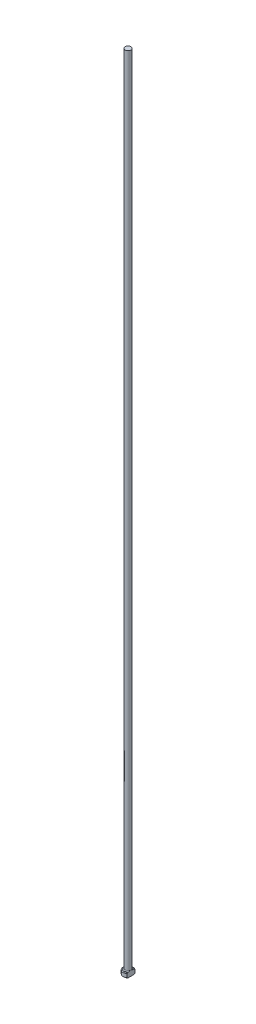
ISO-10303-21;
HEADER;
FILE_DESCRIPTION(('STEP AP214'),'2;1');
FILE_NAME('part.step','',(''),(''),'','','');
FILE_SCHEMA(('AUTOMOTIVE_DESIGN { 1 0 10303 214 1 1 1 1 }'));
ENDSEC;
DATA;
#1=APPLICATION_CONTEXT('core data for automotive mechanical design processes');
#2=APPLICATION_PROTOCOL_DEFINITION('international standard','automotive_design',2000,#1);
#3=PRODUCT_CONTEXT('',#1,'mechanical');
#4=PRODUCT('Part','Part','',(#3));
#5=PRODUCT_RELATED_PRODUCT_CATEGORY('part','',(#4));
#6=PRODUCT_DEFINITION_FORMATION('','',#4);
#7=PRODUCT_DEFINITION_CONTEXT('part definition',#1,'design');
#8=PRODUCT_DEFINITION('design','',#6,#7);
#9=PRODUCT_DEFINITION_SHAPE('','',#8);
#10=(LENGTH_UNIT() NAMED_UNIT(*) SI_UNIT(.MILLI.,.METRE.));
#11=(NAMED_UNIT(*) PLANE_ANGLE_UNIT() SI_UNIT($,.RADIAN.));
#12=(NAMED_UNIT(*) SI_UNIT($,.STERADIAN.) SOLID_ANGLE_UNIT());
#13=UNCERTAINTY_MEASURE_WITH_UNIT(LENGTH_MEASURE(1.E-05),#10,'distance_accuracy_value','');
#14=(GEOMETRIC_REPRESENTATION_CONTEXT(3) GLOBAL_UNCERTAINTY_ASSIGNED_CONTEXT((#13)) GLOBAL_UNIT_ASSIGNED_CONTEXT((#10,
#11,#12)) REPRESENTATION_CONTEXT('',''));
#15=CARTESIAN_POINT('',(0.,0.,0.));
#16=DIRECTION('',(0.,0.,1.));
#17=DIRECTION('',(1.,0.,0.));
#18=AXIS2_PLACEMENT_3D('',#15,#16,#17);
#19=CARTESIAN_POINT('',(0.,0.,0.));
#20=DIRECTION('',(0.,-1.,0.));
#21=DIRECTION('',(0.,0.,-1.));
#22=AXIS2_PLACEMENT_3D('',#19,#20,#21);
#23=PLANE('',#22);
#24=CARTESIAN_POINT('',(0.,0.,0.));
#25=DIRECTION('',(0.,-1.,0.));
#26=DIRECTION('',(0.,0.,-1.));
#27=AXIS2_PLACEMENT_3D('',#24,#25,#26);
#28=CIRCLE('',#27,1.29999999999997);
#29=CARTESIAN_POINT('',(0.899999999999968,0.,0.938083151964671));
#30=VERTEX_POINT('',#29);
#31=CARTESIAN_POINT('',(0.899999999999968,0.,-0.938083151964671));
#32=VERTEX_POINT('',#31);
#33=EDGE_CURVE('E98',#30,#32,#28,.T.);
#34=ORIENTED_EDGE('',*,*,#33,.T.);
#35=DIRECTION('',(0.,0.,1.));
#36=VECTOR('',#35,1.);
#37=CARTESIAN_POINT('',(0.899999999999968,0.,-1.19999999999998));
#38=LINE('',#37,#36);
#39=EDGE_CURVE('E83',#32,#30,#38,.T.);
#40=ORIENTED_EDGE('',*,*,#39,.T.);
#41=EDGE_LOOP('',(#34,#40));
#42=FACE_BOUND('',#41,.T.);
#43=ADVANCED_FACE('F32',(#42),#23,.T.);
#44=CARTESIAN_POINT('',(0.,259.958771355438,0.));
#45=DIRECTION('',(0.,1.,0.));
#46=DIRECTION('',(0.,0.,1.));
#47=AXIS2_PLACEMENT_3D('',#44,#45,#46);
#48=CYLINDRICAL_SURFACE('',#47,1.49999999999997);
#49=CARTESIAN_POINT('',(0.,1.29999999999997,0.));
#50=DIRECTION('',(0.,1.,0.));
#51=DIRECTION('',(0.,0.,1.));
#52=AXIS2_PLACEMENT_3D('',#49,#50,#51);
#53=CIRCLE('',#52,1.49999999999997);
#54=CARTESIAN_POINT('',(0.899999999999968,1.29999999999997,1.19999999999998));
#55=VERTEX_POINT('',#54);
#56=CARTESIAN_POINT('',(0.899999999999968,1.29999999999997,-1.19999999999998));
#57=VERTEX_POINT('',#56);
#58=EDGE_CURVE('E104',#55,#57,#53,.F.);
#59=ORIENTED_EDGE('',*,*,#58,.T.);
#60=DIRECTION('',(0.,-1.,0.));
#61=VECTOR('',#60,1.);
#62=CARTESIAN_POINT('',(0.899999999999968,250.,-1.19999999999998));
#63=LINE('',#62,#61);
#64=CARTESIAN_POINT('',(0.899999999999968,0.199999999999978,-1.19999999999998));
#65=VERTEX_POINT('',#64);
#66=EDGE_CURVE('E183',#57,#65,#63,.T.);
#67=ORIENTED_EDGE('',*,*,#66,.T.);
#68=CARTESIAN_POINT('',(0.,0.199999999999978,0.));
#69=DIRECTION('',(0.,-1.,0.));
#70=DIRECTION('',(0.,0.,-1.));
#71=AXIS2_PLACEMENT_3D('',#68,#69,#70);
#72=CIRCLE('',#71,1.49999999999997);
#73=CARTESIAN_POINT('',(0.899999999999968,0.199999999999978,1.19999999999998));
#74=VERTEX_POINT('',#73);
#75=EDGE_CURVE('E100',#65,#74,#72,.F.);
#76=ORIENTED_EDGE('',*,*,#75,.T.);
#77=DIRECTION('',(0.,-1.,0.));
#78=VECTOR('',#77,1.);
#79=CARTESIAN_POINT('',(0.899999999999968,250.,1.19999999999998));
#80=LINE('',#79,#78);
#81=EDGE_CURVE('E93',#55,#74,#80,.T.);
#82=ORIENTED_EDGE('',*,*,#81,.F.);
#83=EDGE_LOOP('',(#59,#67,#76,#82));
#84=FACE_BOUND('',#83,.T.);
#85=ADVANCED_FACE('F158',(#84),#48,.T.);
#86=CARTESIAN_POINT('',(-1.49999999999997,1.5,0.));
#87=DIRECTION('',(0.,1.,0.));
#88=DIRECTION('',(0.,0.,1.));
#89=AXIS2_PLACEMENT_3D('',#86,#87,#88);
#90=PLANE('',#89);
#91=CARTESIAN_POINT('',(0.,1.5,0.));
#92=DIRECTION('',(0.,1.,0.));
#93=DIRECTION('',(0.,0.,1.));
#94=AXIS2_PLACEMENT_3D('',#91,#92,#93);
#95=CIRCLE('',#94,1.29999999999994);
#96=CARTESIAN_POINT('',(0.899999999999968,1.5,-0.938083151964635));
#97=VERTEX_POINT('',#96);
#98=CARTESIAN_POINT('',(0.899999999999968,1.5,0.938083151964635));
#99=VERTEX_POINT('',#98);
#100=EDGE_CURVE('E178',#97,#99,#95,.T.);
#101=ORIENTED_EDGE('',*,*,#100,.T.);
#102=DIRECTION('',(0.,0.,-1.));
#103=VECTOR('',#102,1.);
#104=CARTESIAN_POINT('',(0.899999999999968,1.5,0.));
#105=LINE('',#104,#103);
#106=CARTESIAN_POINT('',(0.899999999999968,1.49999999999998,0.632455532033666));
#107=VERTEX_POINT('',#106);
#108=EDGE_CURVE('E57',#99,#107,#105,.T.);
#109=ORIENTED_EDGE('',*,*,#108,.T.);
#110=CARTESIAN_POINT('',(0.,1.5,0.));
#111=DIRECTION('',(0.,1.,0.));
#112=DIRECTION('',(0.,0.,1.));
#113=AXIS2_PLACEMENT_3D('',#110,#111,#112);
#114=CIRCLE('',#113,1.09999999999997);
#115=CARTESIAN_POINT('',(0.899999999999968,1.49999999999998,-0.632455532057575));
#116=VERTEX_POINT('',#115);
#117=EDGE_CURVE('E107',#107,#116,#114,.F.);
#118=ORIENTED_EDGE('',*,*,#117,.T.);
#119=EDGE_CURVE('E136',#116,#97,#105,.T.);
#120=ORIENTED_EDGE('',*,*,#119,.T.);
#121=EDGE_LOOP('',(#101,#109,#118,#120));
#122=FACE_BOUND('',#121,.T.);
#123=ADVANCED_FACE('F147',(#122),#90,.T.);
#124=CARTESIAN_POINT('',(0.,1.5,0.));
#125=DIRECTION('',(0.,-1.,0.));
#126=DIRECTION('',(0.,0.,-1.));
#127=AXIS2_PLACEMENT_3D('',#124,#125,#126);
#128=CONICAL_SURFACE('',#127,1.29999999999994,0.785398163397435);
#129=ORIENTED_EDGE('',*,*,#58,.F.);
#130=CARTESIAN_POINT('',(0.899999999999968,0.00589240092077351,2.64519134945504));
#131=CARTESIAN_POINT('',(0.899999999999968,0.0875935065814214,2.55886544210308));
#132=CARTESIAN_POINT('',(0.899999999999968,0.169100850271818,2.47235390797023));
#133=CARTESIAN_POINT('',(0.899999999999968,0.331616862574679,2.29867113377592));
#134=CARTESIAN_POINT('',(0.899999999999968,0.412624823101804,2.21149923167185));
#135=CARTESIAN_POINT('',(0.899999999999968,0.577358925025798,2.03258511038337));
#136=CARTESIAN_POINT('',(0.899999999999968,0.661049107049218,1.94080967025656));
#137=CARTESIAN_POINT('',(0.899999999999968,0.827038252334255,1.75619257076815));
#138=CARTESIAN_POINT('',(0.899999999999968,0.9093386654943,1.6633522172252));
#139=CARTESIAN_POINT('',(0.899999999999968,1.07183067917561,1.47606416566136));
#140=CARTESIAN_POINT('',(0.899999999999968,1.15202519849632,1.3816190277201));
#141=CARTESIAN_POINT('',(0.899999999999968,1.26992152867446,1.23769406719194));
#142=CARTESIAN_POINT('',(0.899999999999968,1.30888905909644,1.18925359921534));
#143=CARTESIAN_POINT('',(0.899999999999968,1.38565831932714,1.0914600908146));
#144=CARTESIAN_POINT('',(0.899999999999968,1.42346015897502,1.04210713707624));
#145=CARTESIAN_POINT('',(0.899999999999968,1.49668885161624,0.943239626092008));
#146=CARTESIAN_POINT('',(0.899999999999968,1.53214870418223,0.893749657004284));
#147=CARTESIAN_POINT('',(0.899999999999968,1.60090132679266,0.793212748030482));
#148=CARTESIAN_POINT('',(0.899999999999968,1.63419242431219,0.742164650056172));
#149=CARTESIAN_POINT('',(0.899999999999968,1.69733745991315,0.638399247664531));
#150=CARTESIAN_POINT('',(0.899999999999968,1.72721157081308,0.585694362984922));
#151=CARTESIAN_POINT('',(0.899999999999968,1.78207526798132,0.477828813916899));
#152=CARTESIAN_POINT('',(0.899999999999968,1.80707433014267,0.422673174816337));
#153=CARTESIAN_POINT('',(0.899999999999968,1.83835305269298,0.339650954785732));
#154=CARTESIAN_POINT('',(0.899999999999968,1.84751725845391,0.312872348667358));
#155=CARTESIAN_POINT('',(0.899999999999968,1.86390997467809,0.258710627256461));
#156=CARTESIAN_POINT('',(0.899999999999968,1.87113784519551,0.231327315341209));
#157=CARTESIAN_POINT('',(0.899999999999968,1.88330445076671,0.176205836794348));
#158=CARTESIAN_POINT('',(0.899999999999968,1.88825539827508,0.148470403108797));
#159=CARTESIAN_POINT('',(0.899999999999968,1.89566404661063,0.092669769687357));
#160=CARTESIAN_POINT('',(0.899999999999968,1.89812233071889,0.064604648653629));
#161=CARTESIAN_POINT('',(0.899999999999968,1.90040685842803,0.00817656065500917));
#162=CARTESIAN_POINT('',(0.899999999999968,1.90021541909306,-0.0201871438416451));
#163=CARTESIAN_POINT('',(0.899999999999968,1.89717544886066,-0.076764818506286));
#164=CARTESIAN_POINT('',(0.899999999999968,1.89432689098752,-0.104978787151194));
#165=CARTESIAN_POINT('',(0.899999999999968,1.88198440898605,-0.189311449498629));
#166=CARTESIAN_POINT('',(0.899999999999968,1.86868632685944,-0.244892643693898));
#167=CARTESIAN_POINT('',(0.899999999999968,1.83784085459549,-0.342756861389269));
#168=CARTESIAN_POINT('',(0.899999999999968,1.82164970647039,-0.385499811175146));
#169=CARTESIAN_POINT('',(0.899999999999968,1.78562895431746,-0.469449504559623));
#170=CARTESIAN_POINT('',(0.899999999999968,1.76579631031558,-0.510654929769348));
#171=CARTESIAN_POINT('',(0.899999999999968,1.72329278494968,-0.592044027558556));
#172=CARTESIAN_POINT('',(0.899999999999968,1.70059692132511,-0.632214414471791));
#173=CARTESIAN_POINT('',(0.899999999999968,1.65325605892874,-0.711354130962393));
#174=CARTESIAN_POINT('',(0.899999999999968,1.62861192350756,-0.750323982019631));
#175=CARTESIAN_POINT('',(0.899999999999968,1.57369928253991,-0.833637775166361));
#176=CARTESIAN_POINT('',(0.899999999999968,1.54317268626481,-0.877810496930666));
#177=CARTESIAN_POINT('',(0.899999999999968,1.48069350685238,-0.965139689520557));
#178=CARTESIAN_POINT('',(0.899999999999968,1.44874066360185,-1.00829597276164));
#179=CARTESIAN_POINT('',(0.899999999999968,1.35127693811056,-1.13662989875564));
#180=CARTESIAN_POINT('',(0.899999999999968,1.28420052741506,-1.22061473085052));
#181=CARTESIAN_POINT('',(0.899999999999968,1.14740677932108,-1.38681927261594));
#182=CARTESIAN_POINT('',(0.899999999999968,1.07768177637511,-1.46903257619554));
#183=CARTESIAN_POINT('',(0.899999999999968,0.936682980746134,-1.63206079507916));
#184=CARTESIAN_POINT('',(0.899999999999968,0.865409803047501,-1.71287624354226));
#185=CARTESIAN_POINT('',(0.899999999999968,0.728966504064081,-1.86553619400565));
#186=CARTESIAN_POINT('',(0.899999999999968,0.663897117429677,-1.93747112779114));
#187=CARTESIAN_POINT('',(0.899999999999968,0.533118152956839,-2.08077158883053));
#188=CARTESIAN_POINT('',(0.899999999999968,0.467408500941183,-2.15213704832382));
#189=CARTESIAN_POINT('',(0.899999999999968,0.335929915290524,-2.29398062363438));
#190=CARTESIAN_POINT('',(0.899999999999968,0.270163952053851,-2.36446149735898));
#191=CARTESIAN_POINT('',(0.899999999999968,0.138274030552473,-2.50506786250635));
#192=CARTESIAN_POINT('',(0.899999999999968,0.0721501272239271,-2.57519340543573));
#193=CARTESIAN_POINT('',(0.899999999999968,0.00589240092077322,-2.64519134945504));
#194=B_SPLINE_CURVE_WITH_KNOTS('',3,(#130,#131,#132,#133,#134,#135,#136,#137,#138,#139,#140,
#141,#142,#143,#144,#145,#146,#147,#148,#149,#150,#151,#152,#153,#154,#155,#156,#157,#158,#159,
#160,#161,#162,#163,#164,#165,#166,#167,#168,#169,#170,#171,#172,#173,#174,#175,#176,#177,#178,
#179,#180,#181,#182,#183,#184,#185,#186,#187,#188,#189,#190,#191,#192,#193),.UNSPECIFIED.,.F.,
.F.,(4,2,2,2,2,2,2,2,2,2,2,2,2,2,2,2,2,2,2,2,2,2,2,2,2,2,2,2,2,2,2,4),(0.,0.356576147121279,
0.713576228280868,1.08618079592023,1.45836906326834,1.8300108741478,2.01650462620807,
2.20298075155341,2.3855887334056,2.56833591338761,2.7499414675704,2.93119042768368,
3.01604159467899,3.10092076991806,3.18533922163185,3.26973791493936,3.3547001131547,
3.43966317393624,3.61026391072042,3.74720161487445,3.88425416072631,4.02259807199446,
4.16088101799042,4.32192495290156,4.48299837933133,4.80535548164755,5.12872978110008,
5.45197789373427,5.7429683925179,6.03399301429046,6.32318782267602,6.61233943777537),.UNSPECIFIED.);
#195=EDGE_CURVE('E135',#55,#99,#194,.T.);
#196=ORIENTED_EDGE('',*,*,#195,.T.);
#197=ORIENTED_EDGE('',*,*,#100,.F.);
#198=EDGE_CURVE('E127',#97,#57,#194,.T.);
#199=ORIENTED_EDGE('',*,*,#198,.T.);
#200=EDGE_LOOP('',(#129,#196,#197,#199));
#201=FACE_BOUND('',#200,.T.);
#202=ADVANCED_FACE('F143',(#201),#128,.T.);
#203=CARTESIAN_POINT('',(0.,0.199999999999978,0.));
#204=DIRECTION('',(0.,1.,0.));
#205=DIRECTION('',(0.,0.,1.));
#206=AXIS2_PLACEMENT_3D('',#203,#204,#205);
#207=CONICAL_SURFACE('',#206,1.49999999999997,0.785398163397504);
#208=ORIENTED_EDGE('',*,*,#75,.F.);
#209=CARTESIAN_POINT('',(0.899999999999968,1.49410759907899,-2.64519134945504));
#210=CARTESIAN_POINT('',(0.899999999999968,1.41240649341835,-2.55886544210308));
#211=CARTESIAN_POINT('',(0.899999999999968,1.33089914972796,-2.47235390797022));
#212=CARTESIAN_POINT('',(0.899999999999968,1.16838313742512,-2.2986711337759));
#213=CARTESIAN_POINT('',(0.899999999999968,1.08737517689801,-2.21149923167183));
#214=CARTESIAN_POINT('',(0.899999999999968,0.922641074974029,-2.03258511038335));
#215=CARTESIAN_POINT('',(0.899999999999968,0.838950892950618,-1.94080967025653));
#216=CARTESIAN_POINT('',(0.899999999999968,0.672961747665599,-1.75619257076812));
#217=CARTESIAN_POINT('',(0.899999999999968,0.590661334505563,-1.66335221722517));
#218=CARTESIAN_POINT('',(0.899999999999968,0.428169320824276,-1.47606416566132));
#219=CARTESIAN_POINT('',(0.899999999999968,0.34797480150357,-1.38161902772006));
#220=CARTESIAN_POINT('',(0.899999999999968,0.230078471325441,-1.23769406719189));
#221=CARTESIAN_POINT('',(0.899999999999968,0.191110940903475,-1.18925359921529));
#222=CARTESIAN_POINT('',(0.899999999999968,0.11434168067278,-1.09146009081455));
#223=CARTESIAN_POINT('',(0.899999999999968,0.0765398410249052,-1.04210713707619));
#224=CARTESIAN_POINT('',(0.899999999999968,0.00331114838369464,-0.943239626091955));
#225=CARTESIAN_POINT('',(0.899999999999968,-0.0321487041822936,-0.89374965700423));
#226=CARTESIAN_POINT('',(0.899999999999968,-0.100901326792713,-0.793212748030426));
#227=CARTESIAN_POINT('',(0.899999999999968,-0.134192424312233,-0.742164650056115));
#228=CARTESIAN_POINT('',(0.899999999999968,-0.197337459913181,-0.638399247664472));
#229=CARTESIAN_POINT('',(0.899999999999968,-0.22721157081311,-0.585694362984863));
#230=CARTESIAN_POINT('',(0.899999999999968,-0.282075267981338,-0.477828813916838));
#231=CARTESIAN_POINT('',(0.899999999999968,-0.307074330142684,-0.422673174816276));
#232=CARTESIAN_POINT('',(0.899999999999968,-0.338353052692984,-0.339650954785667));
#233=CARTESIAN_POINT('',(0.899999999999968,-0.347517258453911,-0.31287234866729));
#234=CARTESIAN_POINT('',(0.899999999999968,-0.363909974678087,-0.258710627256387));
#235=CARTESIAN_POINT('',(0.899999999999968,-0.371137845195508,-0.231327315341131));
#236=CARTESIAN_POINT('',(0.899999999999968,-0.383304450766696,-0.176205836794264));
#237=CARTESIAN_POINT('',(0.899999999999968,-0.388255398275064,-0.14847040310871));
#238=CARTESIAN_POINT('',(0.899999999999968,-0.395664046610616,-0.0926697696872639));
#239=CARTESIAN_POINT('',(0.899999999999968,-0.398122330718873,-0.064604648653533));
#240=CARTESIAN_POINT('',(0.899999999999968,-0.400406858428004,-0.00817656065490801));
#241=CARTESIAN_POINT('',(0.899999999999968,-0.400215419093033,0.0201871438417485));
#242=CARTESIAN_POINT('',(0.899999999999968,-0.397175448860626,0.0767648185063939));
#243=CARTESIAN_POINT('',(0.899999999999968,-0.394326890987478,0.104978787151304));
#244=CARTESIAN_POINT('',(0.899999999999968,-0.381984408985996,0.189311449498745));
#245=CARTESIAN_POINT('',(0.899999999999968,-0.368686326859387,0.244892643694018));
#246=CARTESIAN_POINT('',(0.899999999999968,-0.337840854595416,0.342756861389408));
#247=CARTESIAN_POINT('',(0.899999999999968,-0.321649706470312,0.385499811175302));
#248=CARTESIAN_POINT('',(0.899999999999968,-0.285628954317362,0.469449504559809));
#249=CARTESIAN_POINT('',(0.899999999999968,-0.265796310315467,0.510654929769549));
#250=CARTESIAN_POINT('',(0.899999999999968,-0.223292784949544,0.592044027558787));
#251=CARTESIAN_POINT('',(0.899999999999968,-0.200596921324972,0.632214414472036));
#252=CARTESIAN_POINT('',(0.899999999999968,-0.153256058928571,0.711354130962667));
#253=CARTESIAN_POINT('',(0.899999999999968,-0.128611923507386,0.750323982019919));
#254=CARTESIAN_POINT('',(0.899999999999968,-0.0736992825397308,0.833637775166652));
#255=CARTESIAN_POINT('',(0.899999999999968,-0.0431726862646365,0.877810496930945));
#256=CARTESIAN_POINT('',(0.899999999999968,0.0193064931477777,0.965139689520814));
#257=CARTESIAN_POINT('',(0.899999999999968,0.0512593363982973,1.00829597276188));
#258=CARTESIAN_POINT('',(0.899999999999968,0.148723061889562,1.13662989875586));
#259=CARTESIAN_POINT('',(0.899999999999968,0.215799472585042,1.22061473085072));
#260=CARTESIAN_POINT('',(0.899999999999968,0.35259322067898,1.3868192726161));
#261=CARTESIAN_POINT('',(0.899999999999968,0.422318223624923,1.46903257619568));
#262=CARTESIAN_POINT('',(0.899999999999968,0.563317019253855,1.63206079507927));
#263=CARTESIAN_POINT('',(0.899999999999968,0.634590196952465,1.71287624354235));
#264=CARTESIAN_POINT('',(0.899999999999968,0.771033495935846,1.86553619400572));
#265=CARTESIAN_POINT('',(0.899999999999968,0.836102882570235,1.9374711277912));
#266=CARTESIAN_POINT('',(0.899999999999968,0.966881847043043,2.08077158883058));
#267=CARTESIAN_POINT('',(0.899999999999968,1.03259149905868,2.15213704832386));
#268=CARTESIAN_POINT('',(0.899999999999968,1.16407008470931,2.29398062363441));
#269=CARTESIAN_POINT('',(0.899999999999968,1.22983604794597,2.364461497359));
#270=CARTESIAN_POINT('',(0.899999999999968,1.36172596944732,2.50506786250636));
#271=CARTESIAN_POINT('',(0.899999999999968,1.42784987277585,2.57519340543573));
#272=CARTESIAN_POINT('',(0.899999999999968,1.49410759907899,2.64519134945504));
#273=B_SPLINE_CURVE_WITH_KNOTS('',3,(#209,#210,#211,#212,#213,#214,#215,#216,#217,#218,#219,
#220,#221,#222,#223,#224,#225,#226,#227,#228,#229,#230,#231,#232,#233,#234,#235,#236,#237,#238,
#239,#240,#241,#242,#243,#244,#245,#246,#247,#248,#249,#250,#251,#252,#253,#254,#255,#256,#257,
#258,#259,#260,#261,#262,#263,#264,#265,#266,#267,#268,#269,#270,#271,#272),.UNSPECIFIED.,.F.,
.F.,(4,2,2,2,2,2,2,2,2,2,2,2,2,2,2,2,2,2,2,2,2,2,2,2,2,2,2,2,2,2,2,4),(0.,0.356576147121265,
0.713576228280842,1.08618079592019,1.45836906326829,1.83001087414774,2.016504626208,
2.20298075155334,2.38558873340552,2.56833591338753,2.74994146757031,2.93119042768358,
3.0160415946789,3.10092076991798,3.18533922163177,3.26973791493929,3.35470011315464,
3.43966317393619,3.61026391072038,3.74720161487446,3.88425416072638,4.02259807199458,
4.1608810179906,4.3219249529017,4.48299837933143,4.80535548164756,5.12872978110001,
5.45197789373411,5.7429683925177,6.03399301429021,6.32318782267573,6.61233943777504),.UNSPECIFIED.);
#274=EDGE_CURVE('E86',#65,#32,#273,.T.);
#275=ORIENTED_EDGE('',*,*,#274,.T.);
#276=ORIENTED_EDGE('',*,*,#33,.F.);
#277=EDGE_CURVE('E89',#30,#74,#273,.T.);
#278=ORIENTED_EDGE('',*,*,#277,.T.);
#279=EDGE_LOOP('',(#208,#275,#276,#278));
#280=FACE_BOUND('',#279,.T.);
#281=ADVANCED_FACE('F97',(#280),#207,.T.);
#282=CARTESIAN_POINT('',(0.,1.69999999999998,0.));
#283=DIRECTION('',(0.,1.,0.));
#284=DIRECTION('',(0.,0.,1.));
#285=AXIS2_PLACEMENT_3D('',#282,#283,#284);
#286=TOROIDAL_SURFACE('',#285,1.09999999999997,0.2);
#287=CARTESIAN_POINT('',(0.899999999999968,1.69999999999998,0.));
#288=CARTESIAN_POINT('',(0.899999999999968,1.70000051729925,-4.81752855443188E-12));
#289=CARTESIAN_POINT('',(0.899999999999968,1.70000103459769,-8.83853827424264E-08));
#290=CARTESIAN_POINT('',(0.899999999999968,1.70000203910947,-3.79347123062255E-07));
#291=CARTESIAN_POINT('',(0.899999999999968,1.70000252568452,-5.83791020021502E-07));
#292=CARTESIAN_POINT('',(0.899999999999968,1.70000349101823,-1.07888050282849E-06));
#293=CARTESIAN_POINT('',(0.899999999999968,1.70000396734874,-1.37414928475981E-06));
#294=CARTESIAN_POINT('',(0.899999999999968,1.70000487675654,-2.01876645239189E-06));
#295=CARTESIAN_POINT('',(0.899999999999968,1.70000531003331,-2.36784425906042E-06));
#296=CARTESIAN_POINT('',(0.899999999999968,1.70000672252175,-3.59471376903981E-06));
#297=CARTESIAN_POINT('',(0.899999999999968,1.70000764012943,-4.54411385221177E-06));
#298=CARTESIAN_POINT('',(0.899999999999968,1.70000930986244,-6.53225285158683E-06));
#299=CARTESIAN_POINT('',(0.899999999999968,1.70001006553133,-7.56818772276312E-06));
#300=CARTESIAN_POINT('',(0.899999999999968,1.70001280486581,-1.1504277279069E-05));
#301=CARTESIAN_POINT('',(0.899999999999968,1.70001463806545,-1.45126261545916E-05));
#302=CARTESIAN_POINT('',(0.899999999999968,1.70001772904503,-2.0529366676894E-05));
#303=CARTESIAN_POINT('',(0.899999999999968,1.7000190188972,-2.35219566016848E-05));
#304=CARTESIAN_POINT('',(0.899999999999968,1.70002431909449,-3.59579086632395E-05));
#305=CARTESIAN_POINT('',(0.899999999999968,1.70002821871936,-4.5443001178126E-05));
#306=CARTESIAN_POINT('',(0.899999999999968,1.70003465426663,-6.33834857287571E-05));
#307=CARTESIAN_POINT('',(0.899999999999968,1.70003730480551,-7.17963379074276E-05));
#308=CARTESIAN_POINT('',(0.899999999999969,1.7000577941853,-0.000131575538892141));
#309=CARTESIAN_POINT('',(0.899999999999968,1.70008325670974,-0.000179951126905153));
#310=CARTESIAN_POINT('',(0.899999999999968,1.70017756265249,-0.000366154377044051));
#311=CARTESIAN_POINT('',(0.899999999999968,1.70024074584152,-0.000506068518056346));
#312=CARTESIAN_POINT('',(0.899999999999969,1.70048673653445,-0.00104250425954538));
#313=CARTESIAN_POINT('',(0.899999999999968,1.70067547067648,-0.00143687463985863));
#314=CARTESIAN_POINT('',(0.899999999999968,1.70143326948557,-0.00302835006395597));
#315=CARTESIAN_POINT('',(0.899999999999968,1.70199567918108,-0.004227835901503));
#316=CARTESIAN_POINT('',(0.899999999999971,1.71027509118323,-0.0218760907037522));
#317=CARTESIAN_POINT('',(0.899999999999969,1.71804211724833,-0.0383074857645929));
#318=CARTESIAN_POINT('',(0.899999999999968,1.73319280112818,-0.070653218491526));
#319=CARTESIAN_POINT('',(0.899999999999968,1.740580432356,-0.0865658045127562));
#320=CARTESIAN_POINT('',(0.899999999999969,1.75601133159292,-0.120208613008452));
#321=CARTESIAN_POINT('',(0.899999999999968,1.76403763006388,-0.137946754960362));
#322=CARTESIAN_POINT('',(0.899999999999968,1.77987044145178,-0.173723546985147));
#323=CARTESIAN_POINT('',(0.899999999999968,1.78767412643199,-0.19176344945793));
#324=CARTESIAN_POINT('',(0.899999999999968,1.80675241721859,-0.237275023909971));
#325=CARTESIAN_POINT('',(0.899999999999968,1.81776430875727,-0.2648584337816));
#326=CARTESIAN_POINT('',(0.899999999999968,1.83819603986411,-0.319948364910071));
#327=CARTESIAN_POINT('',(0.899999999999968,1.84764487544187,-0.347443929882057));
#328=CARTESIAN_POINT('',(0.899999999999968,1.86148320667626,-0.392411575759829));
#329=CARTESIAN_POINT('',(0.899999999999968,1.86642863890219,-0.409710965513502));
#330=CARTESIAN_POINT('',(0.899999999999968,1.8755120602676,-0.444608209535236));
#331=CARTESIAN_POINT('',(0.899999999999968,1.87964591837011,-0.462207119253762));
#332=CARTESIAN_POINT('',(0.899999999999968,1.89092217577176,-0.517069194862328));
#333=CARTESIAN_POINT('',(0.899999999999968,1.89638973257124,-0.554723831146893));
#334=CARTESIAN_POINT('',(0.899999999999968,1.90033616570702,-0.618345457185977));
#335=CARTESIAN_POINT('',(0.899999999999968,1.90048945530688,-0.644204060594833));
#336=CARTESIAN_POINT('',(0.899999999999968,1.89710720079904,-0.695408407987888));
#337=CARTESIAN_POINT('',(0.899999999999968,1.89361956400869,-0.720756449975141));
#338=CARTESIAN_POINT('',(0.899999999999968,1.8840925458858,-0.761575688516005));
#339=CARTESIAN_POINT('',(0.899999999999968,1.87939871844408,-0.77735842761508));
#340=CARTESIAN_POINT('',(0.899999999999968,1.8677590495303,-0.808125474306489));
#341=CARTESIAN_POINT('',(0.899999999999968,1.86081090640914,-0.82310894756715));
#342=CARTESIAN_POINT('',(0.899999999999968,1.84643118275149,-0.84802158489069));
#343=CARTESIAN_POINT('',(0.899999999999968,1.83956190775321,-0.858273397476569));
#344=CARTESIAN_POINT('',(0.899999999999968,1.82429709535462,-0.877569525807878));
#345=CARTESIAN_POINT('',(0.899999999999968,1.81590447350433,-0.886616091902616));
#346=CARTESIAN_POINT('',(0.899999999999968,1.79958050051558,-0.90122933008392));
#347=CARTESIAN_POINT('',(0.899999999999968,1.79194496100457,-0.907125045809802));
#348=CARTESIAN_POINT('',(0.899999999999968,1.77580769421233,-0.917595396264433));
#349=CARTESIAN_POINT('',(0.899999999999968,1.76730630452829,-0.922170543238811));
#350=CARTESIAN_POINT('',(0.899999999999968,1.74953707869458,-0.929743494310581));
#351=CARTESIAN_POINT('',(0.899999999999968,1.7402636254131,-0.932728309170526));
#352=CARTESIAN_POINT('',(0.899999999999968,1.72131152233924,-0.936825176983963));
#353=CARTESIAN_POINT('',(0.899999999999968,1.71163321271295,-0.937938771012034));
#354=CARTESIAN_POINT('',(0.899999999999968,1.69353224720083,-0.938184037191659));
#355=CARTESIAN_POINT('',(0.899999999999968,1.68511203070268,-0.937557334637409));
#356=CARTESIAN_POINT('',(0.899999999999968,1.66850650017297,-0.934868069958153));
#357=CARTESIAN_POINT('',(0.899999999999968,1.66032116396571,-0.932805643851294));
#358=CARTESIAN_POINT('',(0.899999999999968,1.64454784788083,-0.927423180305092));
#359=CARTESIAN_POINT('',(0.899999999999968,1.63695168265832,-0.924126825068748));
#360=CARTESIAN_POINT('',(0.899999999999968,1.62233604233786,-0.916445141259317));
#361=CARTESIAN_POINT('',(0.899999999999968,1.61531677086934,-0.912059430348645));
#362=CARTESIAN_POINT('',(0.899999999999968,1.59928568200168,-0.90046071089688));
#363=CARTESIAN_POINT('',(0.899999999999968,1.59058572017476,-0.892815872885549));
#364=CARTESIAN_POINT('',(0.899999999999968,1.5745385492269,-0.876213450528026));
#365=CARTESIAN_POINT('',(0.899999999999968,1.56719456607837,-0.867252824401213));
#366=CARTESIAN_POINT('',(0.899999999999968,1.55118133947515,-0.84466452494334));
#367=CARTESIAN_POINT('',(0.899999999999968,1.54313909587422,-0.830593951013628));
#368=CARTESIAN_POINT('',(0.899999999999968,1.52938683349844,-0.801407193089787));
#369=CARTESIAN_POINT('',(0.899999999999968,1.5236756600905,-0.786291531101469));
#370=CARTESIAN_POINT('',(0.899999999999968,1.51172911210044,-0.74718638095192));
#371=CARTESIAN_POINT('',(0.899999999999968,1.50685445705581,-0.722784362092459));
#372=CARTESIAN_POINT('',(0.899999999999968,1.50081074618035,-0.673272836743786));
#373=CARTESIAN_POINT('',(0.899999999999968,1.49969151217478,-0.648158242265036));
#374=CARTESIAN_POINT('',(0.899999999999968,1.50075906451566,-0.577783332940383));
#375=CARTESIAN_POINT('',(0.899999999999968,1.50633248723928,-0.532580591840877));
#376=CARTESIAN_POINT('',(0.899999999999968,1.51921661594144,-0.466989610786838));
#377=CARTESIAN_POINT('',(0.899999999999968,1.52408424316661,-0.446017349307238));
#378=CARTESIAN_POINT('',(0.899999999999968,1.53497010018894,-0.404492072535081));
#379=CARTESIAN_POINT('',(0.899999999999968,1.54098157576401,-0.383937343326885));
#380=CARTESIAN_POINT('',(0.899999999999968,1.55597324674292,-0.336733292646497));
#381=CARTESIAN_POINT('',(0.899999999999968,1.56529325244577,-0.31019400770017));
#382=CARTESIAN_POINT('',(0.899999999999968,1.58534056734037,-0.256981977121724));
#383=CARTESIAN_POINT('',(0.899999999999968,1.59609461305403,-0.230319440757));
#384=CARTESIAN_POINT('',(0.899999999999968,1.61469335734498,-0.186260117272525));
#385=CARTESIAN_POINT('',(0.899999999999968,1.62230075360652,-0.168761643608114));
#386=CARTESIAN_POINT('',(0.899999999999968,1.63771739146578,-0.134051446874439));
#387=CARTESIAN_POINT('',(0.899999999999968,1.64552404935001,-0.11683857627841));
#388=CARTESIAN_POINT('',(0.899999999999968,1.66052241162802,-0.0841876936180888));
#389=CARTESIAN_POINT('',(0.899999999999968,1.66769861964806,-0.068742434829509));
#390=CARTESIAN_POINT('',(0.899999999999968,1.68241091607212,-0.0373451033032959));
#391=CARTESIAN_POINT('',(0.899999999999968,1.68995069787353,-0.0213946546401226));
#392=CARTESIAN_POINT('',(0.899999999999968,1.69800429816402,-0.00422789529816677));
#393=CARTESIAN_POINT('',(0.899999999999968,1.6985666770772,-0.00302846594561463));
#394=CARTESIAN_POINT('',(0.899999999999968,1.69932446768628,-0.00143700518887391));
#395=CARTESIAN_POINT('',(0.899999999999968,1.69951322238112,-0.001042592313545));
#396=CARTESIAN_POINT('',(0.899999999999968,1.69975923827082,-0.0005061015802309));
#397=CARTESIAN_POINT('',(0.899999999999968,1.69982242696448,-0.00036617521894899));
#398=CARTESIAN_POINT('',(0.899999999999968,1.69991674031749,-0.000179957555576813));
#399=CARTESIAN_POINT('',(0.899999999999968,1.69994220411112,-0.000131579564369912));
#400=CARTESIAN_POINT('',(0.899999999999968,1.69996269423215,-7.17975508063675E-05));
#401=CARTESIAN_POINT('',(0.899999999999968,1.69996534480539,-6.33844949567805E-05));
#402=CARTESIAN_POINT('',(0.899999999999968,1.69997178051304,-4.54435728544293E-05));
#403=CARTESIAN_POINT('',(0.899999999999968,1.69997568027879,-3.59582518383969E-05));
#404=CARTESIAN_POINT('',(0.899999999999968,1.69998098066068,-2.35220424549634E-05));
#405=CARTESIAN_POINT('',(0.899999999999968,1.69998227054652,-2.05294182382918E-05));
#406=CARTESIAN_POINT('',(0.899999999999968,1.69998536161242,-1.45126147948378E-05));
#407=CARTESIAN_POINT('',(0.899999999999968,1.69998719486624,-1.15042383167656E-05));
#408=CARTESIAN_POINT('',(0.899999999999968,1.69998993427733,-7.56812363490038E-06));
#409=CARTESIAN_POINT('',(0.899999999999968,1.69999068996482,-6.53218593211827E-06));
#410=CARTESIAN_POINT('',(0.899999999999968,1.69999235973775,-4.54404507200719E-06));
#411=CARTESIAN_POINT('',(0.899999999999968,1.69999327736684,-3.59464609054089E-06));
#412=CARTESIAN_POINT('',(0.899999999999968,1.69999468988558,-2.367782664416E-06));
#413=CARTESIAN_POINT('',(0.899999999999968,1.69999512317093,-2.0187075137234E-06));
#414=CARTESIAN_POINT('',(0.899999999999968,1.6999960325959,-1.37409717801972E-06));
#415=CARTESIAN_POINT('',(0.899999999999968,1.69999650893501,-1.07883258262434E-06));
#416=CARTESIAN_POINT('',(0.899999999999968,1.69999747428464,-5.83753284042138E-07));
#417=CARTESIAN_POINT('',(0.899999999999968,1.69999796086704,-3.79315230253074E-07));
#418=CARTESIAN_POINT('',(0.899999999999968,1.69999896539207,-8.83675723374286E-08));
#419=CARTESIAN_POINT('',(0.899999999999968,1.69999948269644,4.81756834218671E-12));
#420=CARTESIAN_POINT('',(0.899999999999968,1.69999999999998,0.));
#421=B_SPLINE_CURVE_WITH_KNOTS('',3,(#287,#288,#289,#290,#291,#292,#293,#294,#295,#296,#297,
#298,#299,#300,#301,#302,#303,#304,#305,#306,#307,#308,#309,#310,#311,#312,#313,#314,#315,#316,
#317,#318,#319,#320,#321,#322,#323,#324,#325,#326,#327,#328,#329,#330,#331,#332,#333,#334,#335,
#336,#337,#338,#339,#340,#341,#342,#343,#344,#345,#346,#347,#348,#349,#350,#351,#352,#353,#354,
#355,#356,#357,#358,#359,#360,#361,#362,#363,#364,#365,#366,#367,#368,#369,#370,#371,#372,#373,
#374,#375,#376,#377,#378,#379,#380,#381,#382,#383,#384,#385,#386,#387,#388,#389,#390,#391,#392,
#393,#394,#395,#396,#397,#398,#399,#400,#401,#402,#403,#404,#405,#406,#407,#408,#409,#410,#411,
#412,#413,#414,#415,#416,#417,#418,#419,#420),.UNSPECIFIED.,.T.,.F.,(4,2,2,2,2,2,2,2,2,2,2,2,2,
2,2,2,2,2,2,2,2,2,2,2,2,2,2,2,2,2,2,2,2,2,2,2,2,2,2,2,2,2,2,2,2,2,2,2,2,2,2,2,2,2,2,2,2,2,2,2,2,
2,2,2,2,2,4),(0.,1.55029814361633E-06,3.12621066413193E-06,4.80150809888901E-06,
6.46864070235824E-06,1.04101337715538E-05,1.42537471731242E-05,2.4783374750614E-05,
3.45499426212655E-05,6.53057747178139E-05,9.17408886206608E-05,0.000254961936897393,
0.000716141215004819,0.00202698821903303,0.00600215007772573,0.0605188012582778,
0.113151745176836,0.171557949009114,0.230521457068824,0.319597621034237,0.406770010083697,
0.460726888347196,0.514951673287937,0.628665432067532,0.706058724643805,0.782446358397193,
0.831714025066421,0.881032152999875,0.917931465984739,0.954760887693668,0.983590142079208,
1.01240819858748,1.04145815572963,1.07048417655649,1.09568882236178,1.12089108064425,
1.14563256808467,1.17038275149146,1.20493518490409,1.23956879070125,1.28791845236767,
1.33624413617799,1.41048010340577,1.485697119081,1.6214638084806,1.68604551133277,1.75025708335,
1.83460395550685,1.92083077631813,1.97807032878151,2.03476947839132,2.08586372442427,
2.13878481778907,2.14275978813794,2.14407077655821,2.14453199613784,2.14469522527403,
2.14472166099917,2.14475241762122,2.14476218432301,2.14477271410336,2.14477655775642,
2.14478049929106,2.14478216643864,2.14478384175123,2.1447854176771,2.14478696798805),.UNSPECIFIED.);
#422=CARTESIAN_POINT('',(0.899999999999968,1.69999999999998,0.));
#423=VERTEX_POINT('',#422);
#424=EDGE_CURVE('E11',#116,#423,#421,.T.);
#425=ORIENTED_EDGE('',*,*,#424,.F.);
#426=ORIENTED_EDGE('',*,*,#117,.F.);
#427=CARTESIAN_POINT('',(0.899999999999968,1.69999999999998,0.));
#428=CARTESIAN_POINT('',(0.899999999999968,1.69999948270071,4.81751337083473E-12));
#429=CARTESIAN_POINT('',(0.899999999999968,1.69999896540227,8.8385382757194E-08));
#430=CARTESIAN_POINT('',(0.899999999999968,1.69999796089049,3.79347123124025E-07));
#431=CARTESIAN_POINT('',(0.899999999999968,1.69999747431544,5.83791020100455E-07));
#432=CARTESIAN_POINT('',(0.899999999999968,1.69999650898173,1.07888050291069E-06));
#433=CARTESIAN_POINT('',(0.899999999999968,1.69999603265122,1.3741492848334E-06));
#434=CARTESIAN_POINT('',(0.899999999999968,1.69999512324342,2.01876645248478E-06));
#435=CARTESIAN_POINT('',(0.899999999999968,1.69999468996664,2.36784425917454E-06));
#436=CARTESIAN_POINT('',(0.899999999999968,1.69999327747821,3.59471376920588E-06));
#437=CARTESIAN_POINT('',(0.899999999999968,1.69999235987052,4.54411385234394E-06));
#438=CARTESIAN_POINT('',(0.899999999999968,1.69999069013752,6.53225285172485E-06));
#439=CARTESIAN_POINT('',(0.899999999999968,1.69998993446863,7.5681877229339E-06));
#440=CARTESIAN_POINT('',(0.899999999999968,1.69998719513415,1.15042772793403E-05));
#441=CARTESIAN_POINT('',(0.899999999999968,1.69998536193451,1.45126261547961E-05));
#442=CARTESIAN_POINT('',(0.899999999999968,1.69998227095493,2.05293666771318E-05));
#443=CARTESIAN_POINT('',(0.899999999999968,1.69998098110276,2.35219566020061E-05));
#444=CARTESIAN_POINT('',(0.899999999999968,1.69997568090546,3.59579086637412E-05));
#445=CARTESIAN_POINT('',(0.899999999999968,1.6999717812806,4.54430011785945E-05));
#446=CARTESIAN_POINT('',(0.899999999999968,1.69996534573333,6.33834857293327E-05));
#447=CARTESIAN_POINT('',(0.899999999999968,1.69996269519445,7.17963379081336E-05));
#448=CARTESIAN_POINT('',(0.899999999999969,1.69994220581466,0.000131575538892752));
#449=CARTESIAN_POINT('',(0.899999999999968,1.69991674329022,0.000179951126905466));
#450=CARTESIAN_POINT('',(0.899999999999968,1.69982243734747,0.000366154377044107));
#451=CARTESIAN_POINT('',(0.899999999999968,1.69975925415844,0.000506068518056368));
#452=CARTESIAN_POINT('',(0.899999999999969,1.69951326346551,0.00104250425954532));
#453=CARTESIAN_POINT('',(0.899999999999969,1.69932452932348,0.00143687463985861));
#454=CARTESIAN_POINT('',(0.899999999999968,1.69856673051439,0.00302835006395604));
#455=CARTESIAN_POINT('',(0.899999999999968,1.69800432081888,0.00422783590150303));
#456=CARTESIAN_POINT('',(0.899999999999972,1.68972490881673,0.0218760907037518));
#457=CARTESIAN_POINT('',(0.899999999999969,1.68195788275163,0.0383074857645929));
#458=CARTESIAN_POINT('',(0.899999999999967,1.66680719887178,0.0706532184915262));
#459=CARTESIAN_POINT('',(0.899999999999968,1.65941956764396,0.0865658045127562));
#460=CARTESIAN_POINT('',(0.899999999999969,1.64398866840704,0.120208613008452));
#461=CARTESIAN_POINT('',(0.899999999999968,1.63596236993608,0.137946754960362));
#462=CARTESIAN_POINT('',(0.899999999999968,1.62012955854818,0.173723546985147));
#463=CARTESIAN_POINT('',(0.899999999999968,1.61232587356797,0.19176344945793));
#464=CARTESIAN_POINT('',(0.899999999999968,1.59324758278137,0.237275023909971));
#465=CARTESIAN_POINT('',(0.899999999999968,1.58223569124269,0.2648584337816));
#466=CARTESIAN_POINT('',(0.899999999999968,1.56180396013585,0.319948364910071));
#467=CARTESIAN_POINT('',(0.899999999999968,1.55235512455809,0.347443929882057));
#468=CARTESIAN_POINT('',(0.899999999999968,1.5385167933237,0.392411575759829));
#469=CARTESIAN_POINT('',(0.899999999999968,1.53357136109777,0.409710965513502));
#470=CARTESIAN_POINT('',(0.899999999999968,1.52448793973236,0.444608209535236));
#471=CARTESIAN_POINT('',(0.899999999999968,1.52035408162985,0.462207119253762));
#472=CARTESIAN_POINT('',(0.899999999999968,1.5090778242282,0.517069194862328));
#473=CARTESIAN_POINT('',(0.899999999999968,1.50361026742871,0.554723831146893));
#474=CARTESIAN_POINT('',(0.899999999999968,1.49966383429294,0.618345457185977));
#475=CARTESIAN_POINT('',(0.899999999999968,1.49951054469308,0.644204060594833));
#476=CARTESIAN_POINT('',(0.899999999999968,1.50289279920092,0.695408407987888));
#477=CARTESIAN_POINT('',(0.899999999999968,1.50638043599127,0.720756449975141));
#478=CARTESIAN_POINT('',(0.899999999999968,1.51590745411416,0.761575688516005));
#479=CARTESIAN_POINT('',(0.899999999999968,1.52060128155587,0.77735842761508));
#480=CARTESIAN_POINT('',(0.899999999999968,1.53224095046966,0.808125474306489));
#481=CARTESIAN_POINT('',(0.899999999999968,1.53918909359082,0.82310894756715));
#482=CARTESIAN_POINT('',(0.899999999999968,1.55356881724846,0.84802158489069));
#483=CARTESIAN_POINT('',(0.899999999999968,1.56043809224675,0.858273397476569));
#484=CARTESIAN_POINT('',(0.899999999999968,1.57570290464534,0.877569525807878));
#485=CARTESIAN_POINT('',(0.899999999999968,1.58409552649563,0.886616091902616));
#486=CARTESIAN_POINT('',(0.899999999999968,1.60041949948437,0.90122933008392));
#487=CARTESIAN_POINT('',(0.899999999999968,1.60805503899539,0.907125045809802));
#488=CARTESIAN_POINT('',(0.899999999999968,1.62419230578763,0.917595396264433));
#489=CARTESIAN_POINT('',(0.899999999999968,1.63269369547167,0.922170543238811));
#490=CARTESIAN_POINT('',(0.899999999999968,1.65046292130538,0.929743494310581));
#491=CARTESIAN_POINT('',(0.899999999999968,1.65973637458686,0.932728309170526));
#492=CARTESIAN_POINT('',(0.899999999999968,1.67868847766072,0.936825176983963));
#493=CARTESIAN_POINT('',(0.899999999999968,1.68836678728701,0.937938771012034));
#494=CARTESIAN_POINT('',(0.899999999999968,1.70646775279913,0.938184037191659));
#495=CARTESIAN_POINT('',(0.899999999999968,1.71488796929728,0.937557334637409));
#496=CARTESIAN_POINT('',(0.899999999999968,1.73149349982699,0.934868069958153));
#497=CARTESIAN_POINT('',(0.899999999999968,1.73967883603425,0.932805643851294));
#498=CARTESIAN_POINT('',(0.899999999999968,1.75545215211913,0.927423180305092));
#499=CARTESIAN_POINT('',(0.899999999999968,1.76304831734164,0.924126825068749));
#500=CARTESIAN_POINT('',(0.899999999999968,1.77766395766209,0.916445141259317));
#501=CARTESIAN_POINT('',(0.899999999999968,1.78468322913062,0.912059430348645));
#502=CARTESIAN_POINT('',(0.899999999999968,1.80071431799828,0.90046071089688));
#503=CARTESIAN_POINT('',(0.899999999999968,1.8094142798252,0.892815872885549));
#504=CARTESIAN_POINT('',(0.899999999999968,1.82546145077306,0.876213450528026));
#505=CARTESIAN_POINT('',(0.899999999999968,1.83280543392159,0.867252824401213));
#506=CARTESIAN_POINT('',(0.899999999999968,1.84881866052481,0.84466452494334));
#507=CARTESIAN_POINT('',(0.899999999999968,1.85686090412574,0.830593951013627));
#508=CARTESIAN_POINT('',(0.899999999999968,1.87061316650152,0.801407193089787));
#509=CARTESIAN_POINT('',(0.899999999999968,1.87632433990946,0.786291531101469));
#510=CARTESIAN_POINT('',(0.899999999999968,1.88827088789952,0.74718638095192));
#511=CARTESIAN_POINT('',(0.899999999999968,1.89314554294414,0.722784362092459));
#512=CARTESIAN_POINT('',(0.899999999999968,1.89918925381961,0.673272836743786));
#513=CARTESIAN_POINT('',(0.899999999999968,1.90030848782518,0.648158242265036));
#514=CARTESIAN_POINT('',(0.899999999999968,1.8992409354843,0.577783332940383));
#515=CARTESIAN_POINT('',(0.899999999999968,1.89366751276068,0.532580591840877));
#516=CARTESIAN_POINT('',(0.899999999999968,1.88078338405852,0.466989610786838));
#517=CARTESIAN_POINT('',(0.899999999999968,1.87591575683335,0.446017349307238));
#518=CARTESIAN_POINT('',(0.899999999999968,1.86502989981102,0.404492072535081));
#519=CARTESIAN_POINT('',(0.899999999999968,1.85901842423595,0.383937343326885));
#520=CARTESIAN_POINT('',(0.899999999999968,1.84402675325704,0.336733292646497));
#521=CARTESIAN_POINT('',(0.899999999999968,1.83470674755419,0.31019400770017));
#522=CARTESIAN_POINT('',(0.899999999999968,1.81465943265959,0.256981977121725));
#523=CARTESIAN_POINT('',(0.899999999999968,1.80390538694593,0.230319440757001));
#524=CARTESIAN_POINT('',(0.899999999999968,1.78530664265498,0.186260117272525));
#525=CARTESIAN_POINT('',(0.899999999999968,1.77769924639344,0.168761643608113));
#526=CARTESIAN_POINT('',(0.899999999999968,1.76228260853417,0.134051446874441));
#527=CARTESIAN_POINT('',(0.899999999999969,1.75447595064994,0.116838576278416));
#528=CARTESIAN_POINT('',(0.899999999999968,1.73947758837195,0.0841876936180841));
#529=CARTESIAN_POINT('',(0.899999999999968,1.73230138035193,0.0687424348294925));
#530=CARTESIAN_POINT('',(0.899999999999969,1.71758908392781,0.0373451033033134));
#531=CARTESIAN_POINT('',(0.899999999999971,1.71004930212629,0.0213946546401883));
#532=CARTESIAN_POINT('',(0.899999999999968,1.70199570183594,0.00422789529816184));
#533=CARTESIAN_POINT('',(0.899999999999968,1.70143332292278,0.00302846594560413));
#534=CARTESIAN_POINT('',(0.899999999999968,1.70067553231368,0.00143700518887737));
#535=CARTESIAN_POINT('',(0.899999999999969,1.70048677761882,0.00104259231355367));
#536=CARTESIAN_POINT('',(0.899999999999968,1.70024076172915,0.000506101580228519));
#537=CARTESIAN_POINT('',(0.899999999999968,1.7001775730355,0.000366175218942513));
#538=CARTESIAN_POINT('',(0.899999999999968,1.70008325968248,0.000179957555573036));
#539=CARTESIAN_POINT('',(0.899999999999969,1.70005779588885,0.000131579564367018));
#540=CARTESIAN_POINT('',(0.899999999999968,1.70003730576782,7.17975508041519E-05));
#541=CARTESIAN_POINT('',(0.899999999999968,1.70003465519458,6.3384494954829E-05));
#542=CARTESIAN_POINT('',(0.899999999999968,1.70002821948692,4.54435728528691E-05));
#543=CARTESIAN_POINT('',(0.899999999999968,1.70002431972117,3.59582518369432E-05));
#544=CARTESIAN_POINT('',(0.899999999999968,1.70001901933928,2.35220424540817E-05));
#545=CARTESIAN_POINT('',(0.899999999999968,1.70001772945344,2.05294182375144E-05));
#546=CARTESIAN_POINT('',(0.899999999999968,1.70001463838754,1.45126147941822E-05));
#547=CARTESIAN_POINT('',(0.899999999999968,1.70001280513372,1.15042383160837E-05));
#548=CARTESIAN_POINT('',(0.899999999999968,1.70001006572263,7.56812363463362E-06));
#549=CARTESIAN_POINT('',(0.899999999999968,1.70000931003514,6.53218593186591E-06));
#550=CARTESIAN_POINT('',(0.899999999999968,1.70000764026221,4.54404507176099E-06));
#551=CARTESIAN_POINT('',(0.899999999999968,1.70000672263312,3.59464609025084E-06));
#552=CARTESIAN_POINT('',(0.899999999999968,1.70000531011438,2.36778266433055E-06));
#553=CARTESIAN_POINT('',(0.899999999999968,1.70000487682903,2.01870751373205E-06));
#554=CARTESIAN_POINT('',(0.899999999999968,1.70000396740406,1.37409717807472E-06));
#555=CARTESIAN_POINT('',(0.899999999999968,1.70000349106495,1.0788325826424E-06));
#556=CARTESIAN_POINT('',(0.899999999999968,1.70000252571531,5.8375328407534E-07));
#557=CARTESIAN_POINT('',(0.899999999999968,1.70000203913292,3.79315230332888E-07));
#558=CARTESIAN_POINT('',(0.899999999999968,1.70000103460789,8.83675724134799E-08));
#559=CARTESIAN_POINT('',(0.899999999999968,1.70000051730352,-4.81755315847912E-12));
#560=CARTESIAN_POINT('',(0.899999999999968,1.69999999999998,0.));
#561=B_SPLINE_CURVE_WITH_KNOTS('',3,(#427,#428,#429,#430,#431,#432,#433,#434,#435,#436,#437,
#438,#439,#440,#441,#442,#443,#444,#445,#446,#447,#448,#449,#450,#451,#452,#453,#454,#455,#456,
#457,#458,#459,#460,#461,#462,#463,#464,#465,#466,#467,#468,#469,#470,#471,#472,#473,#474,#475,
#476,#477,#478,#479,#480,#481,#482,#483,#484,#485,#486,#487,#488,#489,#490,#491,#492,#493,#494,
#495,#496,#497,#498,#499,#500,#501,#502,#503,#504,#505,#506,#507,#508,#509,#510,#511,#512,#513,
#514,#515,#516,#517,#518,#519,#520,#521,#522,#523,#524,#525,#526,#527,#528,#529,#530,#531,#532,
#533,#534,#535,#536,#537,#538,#539,#540,#541,#542,#543,#544,#545,#546,#547,#548,#549,#550,#551,
#552,#553,#554,#555,#556,#557,#558,#559,#560),.UNSPECIFIED.,.T.,.F.,(4,2,2,2,2,2,2,2,2,2,2,2,2,
2,2,2,2,2,2,2,2,2,2,2,2,2,2,2,2,2,2,2,2,2,2,2,2,2,2,2,2,2,2,2,2,2,2,2,2,2,2,2,2,2,2,2,2,2,2,2,2,
2,2,2,2,2,4),(0.,1.55029814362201E-06,3.1262106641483E-06,4.80150809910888E-06,
6.46864070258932E-06,1.04101337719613E-05,1.42537471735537E-05,2.4783374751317E-05,
3.45499426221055E-05,6.53057747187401E-05,9.17408886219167E-05,0.000254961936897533,
0.000716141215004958,0.00202698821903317,0.00600215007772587,0.0605188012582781,
0.113151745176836,0.171557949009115,0.230521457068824,0.319597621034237,0.406770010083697,
0.460726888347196,0.514951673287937,0.628665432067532,0.706058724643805,0.782446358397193,
0.831714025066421,0.881032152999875,0.917931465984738,0.954760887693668,0.983590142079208,
1.01240819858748,1.04145815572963,1.07048417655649,1.09568882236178,1.12089108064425,
1.14563256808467,1.17038275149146,1.20493518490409,1.23956879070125,1.28791845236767,
1.33624413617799,1.41048010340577,1.485697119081,1.6214638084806,1.68604551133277,1.75025708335,
1.83460395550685,1.92083077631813,1.97807032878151,2.03476947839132,2.08586372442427,
2.13878481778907,2.14275978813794,2.14407077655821,2.14453199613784,2.14469522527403,
2.14472166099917,2.14475241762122,2.14476218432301,2.14477271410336,2.14477655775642,
2.14478049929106,2.14478216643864,2.14478384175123,2.1447854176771,2.14478696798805),.UNSPECIFIED.);
#562=EDGE_CURVE('E46',#423,#107,#561,.T.);
#563=ORIENTED_EDGE('',*,*,#562,.F.);
#564=CARTESIAN_POINT('',(0.,1.69999999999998,0.));
#565=DIRECTION('',(0.,1.,0.));
#566=DIRECTION('',(0.,0.,1.));
#567=AXIS2_PLACEMENT_3D('',#564,#565,#566);
#568=CIRCLE('',#567,0.899999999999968);
#569=EDGE_CURVE('E103',#423,#423,#568,.T.);
#570=ORIENTED_EDGE('',*,*,#569,.F.);
#571=EDGE_LOOP('',(#425,#426,#563,#570));
#572=FACE_BOUND('',#571,.T.);
#573=ADVANCED_FACE('F34',(#572),#286,.F.);
#574=CARTESIAN_POINT('',(0.,259.958771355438,0.));
#575=DIRECTION('',(0.,1.,0.));
#576=DIRECTION('',(0.,0.,1.));
#577=AXIS2_PLACEMENT_3D('',#574,#575,#576);
#578=CYLINDRICAL_SURFACE('',#577,0.899999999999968);
#579=ORIENTED_EDGE('',*,*,#569,.T.);
#580=EDGE_LOOP('',(#579));
#581=FACE_BOUND('',#580,.T.);
#582=CARTESIAN_POINT('',(0.,250.,0.));
#583=DIRECTION('',(0.,1.,0.));
#584=DIRECTION('',(0.,0.,1.));
#585=AXIS2_PLACEMENT_3D('',#582,#583,#584);
#586=CIRCLE('',#585,0.899999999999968);
#587=CARTESIAN_POINT('',(0.,250.,0.899999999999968));
#588=VERTEX_POINT('',#587);
#589=EDGE_CURVE('E101',#588,#588,#586,.T.);
#590=ORIENTED_EDGE('',*,*,#589,.F.);
#591=EDGE_LOOP('',(#590));
#592=FACE_BOUND('',#591,.T.);
#593=ADVANCED_FACE('F155',(#581,#592),#578,.T.);
#594=CARTESIAN_POINT('',(-0.899999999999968,250.,0.));
#595=DIRECTION('',(0.,1.,0.));
#596=DIRECTION('',(0.,0.,1.));
#597=AXIS2_PLACEMENT_3D('',#594,#595,#596);
#598=PLANE('',#597);
#599=ORIENTED_EDGE('',*,*,#589,.T.);
#600=EDGE_LOOP('',(#599));
#601=FACE_BOUND('',#600,.T.);
#602=ADVANCED_FACE('F121',(#601),#598,.T.);
#603=CARTESIAN_POINT('',(0.899999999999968,250.,-1.19999999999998));
#604=DIRECTION('',(1.,0.,0.));
#605=DIRECTION('',(0.,0.,-1.));
#606=AXIS2_PLACEMENT_3D('',#603,#604,#605);
#607=PLANE('',#606);
#608=ORIENTED_EDGE('',*,*,#66,.F.);
#609=ORIENTED_EDGE('',*,*,#198,.F.);
#610=ORIENTED_EDGE('',*,*,#119,.F.);
#611=ORIENTED_EDGE('',*,*,#424,.T.);
#612=ORIENTED_EDGE('',*,*,#562,.T.);
#613=ORIENTED_EDGE('',*,*,#108,.F.);
#614=ORIENTED_EDGE('',*,*,#195,.F.);
#615=ORIENTED_EDGE('',*,*,#81,.T.);
#616=ORIENTED_EDGE('',*,*,#277,.F.);
#617=ORIENTED_EDGE('',*,*,#39,.F.);
#618=ORIENTED_EDGE('',*,*,#274,.F.);
#619=EDGE_LOOP('',(#608,#609,#610,#611,#612,#613,#614,#615,#616,#617,#618));
#620=FACE_BOUND('',#619,.T.);
#621=ADVANCED_FACE('F85',(#620),#607,.T.);
#622=CLOSED_SHELL('',(#43,#85,#123,#202,#281,#573,#593,#602,#621));
#623=MANIFOLD_SOLID_BREP('B2',#622);
#624=ADVANCED_BREP_SHAPE_REPRESENTATION('',(#18,#623),#14);
#625=SHAPE_DEFINITION_REPRESENTATION(#9,#624);
ENDSEC;
END-ISO-10303-21;
